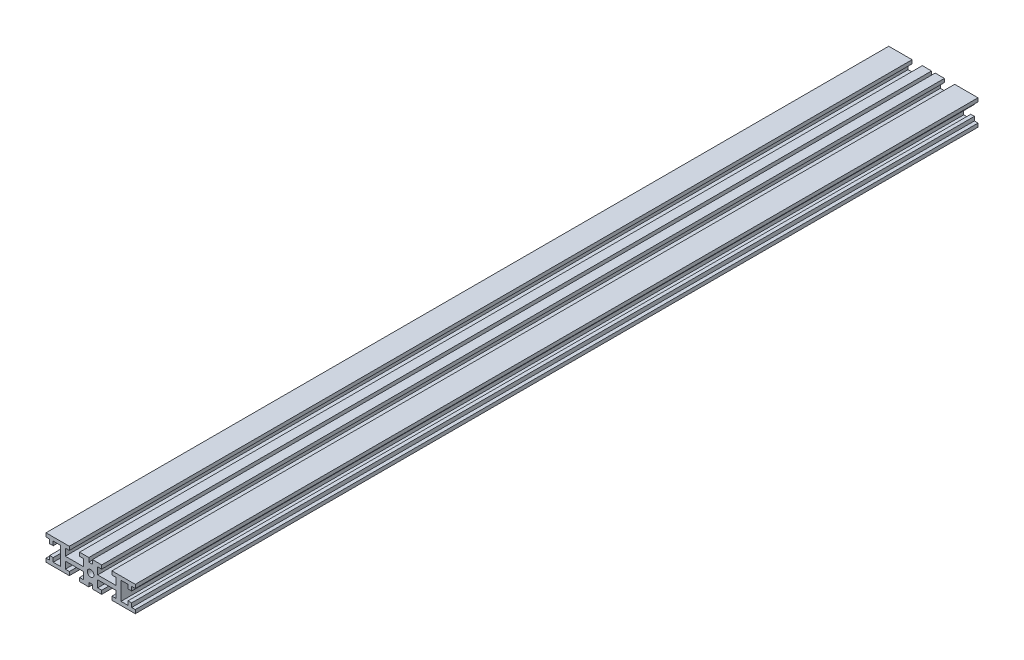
from build123d import *

# Parameters (mm, degrees)
BOSS_EXTRUDE1_DEPTH = 419.6
M4_TAPPED_HOLE1_D   = 3.3
SKETCH5_W           = 1.8
SKETCH5_H           = 2
CUT_EXTRUDE1_DEPTH  = 421.236163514


with BuildPart() as part:
    # Sketch1 → Boss-Extrude1 (new body)
    with BuildSketch(Plane.XY):
        Polygon((5.5, 6.35), (-5.5, 6.35), (-5.5, 4.55), (-3.5, 4.55), (-3.5, 1.05), (-12.6, 1.05), (-12.6, 4.55), (-10.6, 4.55), (-10.6, 6.35), (-22.225, 6.35), (-22.225, 4.55), (-20.425, 4.55), (-20.425, 2.55), (-18.625, 2.55), (-18.625, 4.55), (-15.125, 4.55), (-15.125, -4.55), (-18.625, -4.55), (-18.625, -2.55), (-20.425, -2.55), (-20.425, -4.55), (-22.225, -4.55), (-22.225, -6.35), (-10.6, -6.35), (-10.6, -4.55), (-12.6, -4.55), (-12.6, -1.05), (-3.5, -1.05), (-3.5, -4.55), (-5.5, -4.55), (-5.5, -6.35), (5.5, -6.35), (5.5, -4.55), (3.5, -4.55), (3.5, -1.05), (12.6, -1.05), (12.6, -4.55), (10.6, -4.55), (10.6, -6.35), (22.225, -6.35), (22.225, -4.55), (20.425, -4.55), (20.425, -2.55), (18.625, -2.55), (18.625, -4.55), (15.125, -4.55), (15.125, 4.55), (18.625, 4.55), (18.625, 2.55), (20.425, 2.55), (20.425, 4.55), (22.225, 4.55), (22.225, 6.35), (10.6, 6.35), (10.6, 4.55), (12.6, 4.55), (12.6, 1.05), (3.5, 1.05), (3.5, 4.55), (5.5, 4.55), align=None)
    extrude(amount=BOSS_EXTRUDE1_DEPTH)

    # M4 Tapped Hole1 (through all)
    with Locations(Plane.XY.offset(419.6)):
        with Locations((0, 0)):
            Hole(M4_TAPPED_HOLE1_D / 2)

    # Sketch5 → Cut-Extrude1 (cut, through all)
    with BuildSketch(Plane.XY.offset(419.6)):
        with Locations((0, -5.35)):
            Rectangle(SKETCH5_W, SKETCH5_H)
        with Locations((0, 5.35)):
            Rectangle(SKETCH5_W, SKETCH5_H)
    extrude(amount=-CUT_EXTRUDE1_DEPTH, mode=Mode.SUBTRACT)


solid = part.part
